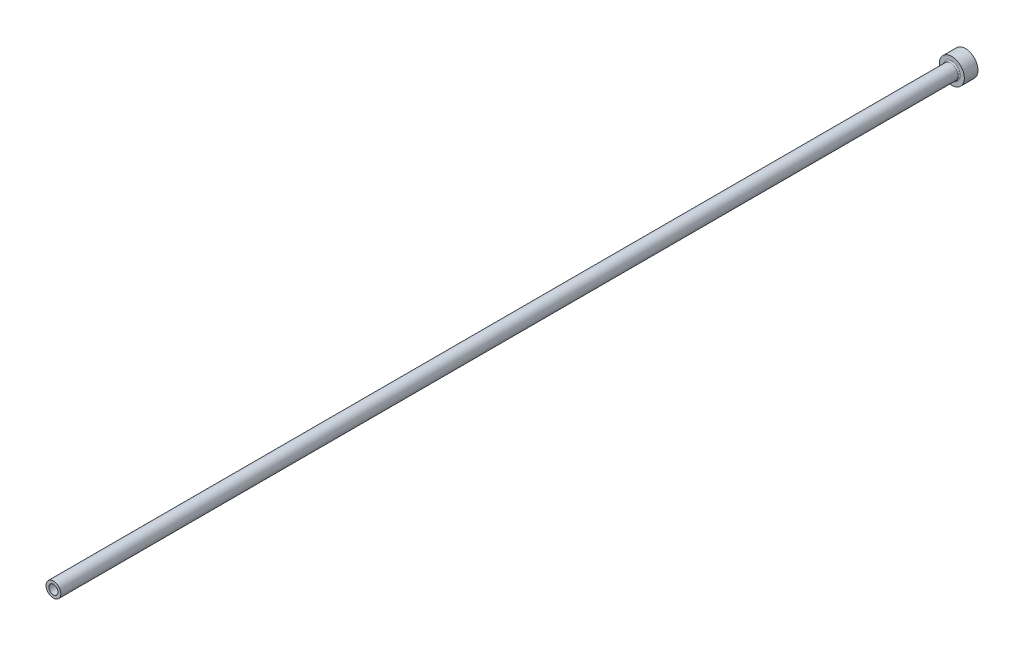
ISO-10303-21;
HEADER;
FILE_DESCRIPTION(('STEP AP214'),'2;1');
FILE_NAME('part.step','',(''),(''),'','','');
FILE_SCHEMA(('AUTOMOTIVE_DESIGN { 1 0 10303 214 1 1 1 1 }'));
ENDSEC;
DATA;
#1=APPLICATION_CONTEXT('core data for automotive mechanical design processes');
#2=APPLICATION_PROTOCOL_DEFINITION('international standard','automotive_design',2000,#1);
#3=PRODUCT_CONTEXT('',#1,'mechanical');
#4=PRODUCT('Part','Part','',(#3));
#5=PRODUCT_RELATED_PRODUCT_CATEGORY('part','',(#4));
#6=PRODUCT_DEFINITION_FORMATION('','',#4);
#7=PRODUCT_DEFINITION_CONTEXT('part definition',#1,'design');
#8=PRODUCT_DEFINITION('design','',#6,#7);
#9=PRODUCT_DEFINITION_SHAPE('','',#8);
#10=(LENGTH_UNIT() NAMED_UNIT(*) SI_UNIT(.MILLI.,.METRE.));
#11=(NAMED_UNIT(*) PLANE_ANGLE_UNIT() SI_UNIT($,.RADIAN.));
#12=(NAMED_UNIT(*) SI_UNIT($,.STERADIAN.) SOLID_ANGLE_UNIT());
#13=UNCERTAINTY_MEASURE_WITH_UNIT(LENGTH_MEASURE(1.E-05),#10,'distance_accuracy_value','');
#14=(GEOMETRIC_REPRESENTATION_CONTEXT(3) GLOBAL_UNCERTAINTY_ASSIGNED_CONTEXT((#13)) GLOBAL_UNIT_ASSIGNED_CONTEXT((#10,
#11,#12)) REPRESENTATION_CONTEXT('',''));
#15=CARTESIAN_POINT('',(0.,0.,0.));
#16=DIRECTION('',(0.,0.,1.));
#17=DIRECTION('',(1.,0.,0.));
#18=AXIS2_PLACEMENT_3D('',#15,#16,#17);
#19=CARTESIAN_POINT('',(0.,0.,400.));
#20=DIRECTION('',(0.,0.,-1.));
#21=DIRECTION('',(-1.,0.,0.));
#22=AXIS2_PLACEMENT_3D('',#19,#20,#21);
#23=PLANE('',#22);
#24=CARTESIAN_POINT('',(0.,0.,400.));
#25=DIRECTION('',(0.,0.,1.));
#26=DIRECTION('',(1.,0.,0.));
#27=AXIS2_PLACEMENT_3D('',#24,#25,#26);
#28=CIRCLE('',#27,1.99999999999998);
#29=CARTESIAN_POINT('',(1.99999999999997,0.,400.));
#30=VERTEX_POINT('',#29);
#31=EDGE_CURVE('E63',#30,#30,#28,.T.);
#32=ORIENTED_EDGE('',*,*,#31,.F.);
#33=EDGE_LOOP('',(#32));
#34=FACE_BOUND('',#33,.T.);
#35=CARTESIAN_POINT('',(0.,0.,400.));
#36=DIRECTION('',(0.,0.,1.));
#37=DIRECTION('',(1.,0.,0.));
#38=AXIS2_PLACEMENT_3D('',#35,#36,#37);
#39=CIRCLE('',#38,3.24999999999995);
#40=CARTESIAN_POINT('',(3.24999999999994,0.,400.));
#41=VERTEX_POINT('',#40);
#42=EDGE_CURVE('E54',#41,#41,#39,.T.);
#43=ORIENTED_EDGE('',*,*,#42,.T.);
#44=EDGE_LOOP('',(#43));
#45=FACE_BOUND('',#44,.T.);
#46=ADVANCED_FACE('F34',(#34,#45),#23,.F.);
#47=CARTESIAN_POINT('',(0.,0.,400.));
#48=DIRECTION('',(0.,0.,1.));
#49=DIRECTION('',(1.,0.,0.));
#50=AXIS2_PLACEMENT_3D('',#47,#48,#49);
#51=CYLINDRICAL_SURFACE('',#50,3.24999999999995);
#52=CARTESIAN_POINT('',(0.,0.,6.50000000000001));
#53=DIRECTION('',(0.,0.,1.));
#54=DIRECTION('',(1.,0.,0.));
#55=AXIS2_PLACEMENT_3D('',#52,#53,#54);
#56=CIRCLE('',#55,3.24999999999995);
#57=CARTESIAN_POINT('',(3.24999999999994,0.,6.50000000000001));
#58=VERTEX_POINT('',#57);
#59=EDGE_CURVE('E49',#58,#58,#56,.T.);
#60=ORIENTED_EDGE('',*,*,#59,.T.);
#61=EDGE_LOOP('',(#60));
#62=FACE_BOUND('',#61,.T.);
#63=ORIENTED_EDGE('',*,*,#42,.F.);
#64=EDGE_LOOP('',(#63));
#65=FACE_BOUND('',#64,.T.);
#66=ADVANCED_FACE('F92',(#62,#65),#51,.T.);
#67=CARTESIAN_POINT('',(0.,0.,6.));
#68=DIRECTION('',(0.,0.,1.));
#69=DIRECTION('',(1.,0.,0.));
#70=AXIS2_PLACEMENT_3D('',#67,#68,#69);
#71=PLANE('',#70);
#72=CARTESIAN_POINT('',(0.,0.,6.));
#73=DIRECTION('',(0.,0.,1.));
#74=DIRECTION('',(1.,0.,0.));
#75=AXIS2_PLACEMENT_3D('',#72,#73,#74);
#76=CIRCLE('',#75,3.74999999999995);
#77=CARTESIAN_POINT('',(3.74999999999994,0.,6.));
#78=VERTEX_POINT('',#77);
#79=EDGE_CURVE('E45',#78,#78,#76,.F.);
#80=ORIENTED_EDGE('',*,*,#79,.T.);
#81=EDGE_LOOP('',(#80));
#82=FACE_BOUND('',#81,.T.);
#83=CARTESIAN_POINT('',(0.,0.,6.00000000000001));
#84=DIRECTION('',(0.,0.,1.));
#85=DIRECTION('',(1.,0.,0.));
#86=AXIS2_PLACEMENT_3D('',#83,#84,#85);
#87=CIRCLE('',#86,5.49999999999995);
#88=CARTESIAN_POINT('',(5.49999999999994,0.,6.00000000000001));
#89=VERTEX_POINT('',#88);
#90=EDGE_CURVE('E57',#89,#89,#87,.T.);
#91=ORIENTED_EDGE('',*,*,#90,.T.);
#92=EDGE_LOOP('',(#91));
#93=FACE_BOUND('',#92,.T.);
#94=ADVANCED_FACE('F98',(#82,#93),#71,.T.);
#95=CARTESIAN_POINT('',(0.,0.,400.));
#96=DIRECTION('',(0.,0.,1.));
#97=DIRECTION('',(1.,0.,0.));
#98=AXIS2_PLACEMENT_3D('',#95,#96,#97);
#99=CYLINDRICAL_SURFACE('',#98,5.49999999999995);
#100=ORIENTED_EDGE('',*,*,#90,.F.);
#101=EDGE_LOOP('',(#100));
#102=FACE_BOUND('',#101,.T.);
#103=CARTESIAN_POINT('',(0.,0.,0.));
#104=DIRECTION('',(0.,0.,1.));
#105=DIRECTION('',(1.,0.,0.));
#106=AXIS2_PLACEMENT_3D('',#103,#104,#105);
#107=CIRCLE('',#106,5.49999999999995);
#108=CARTESIAN_POINT('',(5.49999999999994,0.,0.));
#109=VERTEX_POINT('',#108);
#110=EDGE_CURVE('E60',#109,#109,#107,.T.);
#111=ORIENTED_EDGE('',*,*,#110,.T.);
#112=EDGE_LOOP('',(#111));
#113=FACE_BOUND('',#112,.T.);
#114=ADVANCED_FACE('F89',(#102,#113),#99,.T.);
#115=CARTESIAN_POINT('',(0.,0.,0.));
#116=DIRECTION('',(0.,0.,1.));
#117=DIRECTION('',(1.,0.,0.));
#118=AXIS2_PLACEMENT_3D('',#115,#116,#117);
#119=PLANE('',#118);
#120=CARTESIAN_POINT('',(0.,0.,0.));
#121=DIRECTION('',(0.,0.,1.));
#122=DIRECTION('',(1.,0.,0.));
#123=AXIS2_PLACEMENT_3D('',#120,#121,#122);
#124=CIRCLE('',#123,2.75000000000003);
#125=CARTESIAN_POINT('',(2.75,0.,0.));
#126=VERTEX_POINT('',#125);
#127=EDGE_CURVE('E41',#126,#126,#124,.T.);
#128=ORIENTED_EDGE('',*,*,#127,.T.);
#129=EDGE_LOOP('',(#128));
#130=FACE_BOUND('',#129,.T.);
#131=ORIENTED_EDGE('',*,*,#110,.F.);
#132=EDGE_LOOP('',(#131));
#133=FACE_BOUND('',#132,.T.);
#134=ADVANCED_FACE('F83',(#130,#133),#119,.F.);
#135=CARTESIAN_POINT('',(0.,0.,400.));
#136=DIRECTION('',(0.,0.,1.));
#137=DIRECTION('',(1.,0.,0.));
#138=AXIS2_PLACEMENT_3D('',#135,#136,#137);
#139=CYLINDRICAL_SURFACE('',#138,2.00000000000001);
#140=ORIENTED_EDGE('',*,*,#31,.T.);
#141=EDGE_LOOP('',(#140));
#142=FACE_BOUND('',#141,.T.);
#143=CARTESIAN_POINT('',(0.,0.,250.));
#144=DIRECTION('',(0.,0.,1.));
#145=DIRECTION('',(1.,0.,0.));
#146=AXIS2_PLACEMENT_3D('',#143,#144,#145);
#147=CIRCLE('',#146,2.00000000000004);
#148=CARTESIAN_POINT('',(2.00000000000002,0.,250.));
#149=VERTEX_POINT('',#148);
#150=EDGE_CURVE('E66',#149,#149,#147,.T.);
#151=ORIENTED_EDGE('',*,*,#150,.F.);
#152=EDGE_LOOP('',(#151));
#153=FACE_BOUND('',#152,.T.);
#154=ADVANCED_FACE('F78',(#142,#153),#139,.F.);
#155=CARTESIAN_POINT('',(0.,0.,250.));
#156=DIRECTION('',(0.,0.,-1.));
#157=DIRECTION('',(-1.,0.,0.));
#158=AXIS2_PLACEMENT_3D('',#155,#156,#157);
#159=CONICAL_SURFACE('',#158,2.00000000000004,0.523598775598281);
#160=CARTESIAN_POINT('',(0.,0.,249.566987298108));
#161=DIRECTION('',(0.,0.,1.));
#162=DIRECTION('',(1.,0.,0.));
#163=AXIS2_PLACEMENT_3D('',#160,#161,#162);
#164=CIRCLE('',#163,2.25);
#165=CARTESIAN_POINT('',(2.24999999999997,0.,249.566987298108));
#166=VERTEX_POINT('',#165);
#167=EDGE_CURVE('E69',#166,#166,#164,.T.);
#168=ORIENTED_EDGE('',*,*,#167,.F.);
#169=EDGE_LOOP('',(#168));
#170=FACE_BOUND('',#169,.T.);
#171=ORIENTED_EDGE('',*,*,#150,.T.);
#172=EDGE_LOOP('',(#171));
#173=FACE_BOUND('',#172,.T.);
#174=ADVANCED_FACE('F75',(#170,#173),#159,.F.);
#175=CARTESIAN_POINT('',(0.,0.,400.));
#176=DIRECTION('',(0.,0.,1.));
#177=DIRECTION('',(1.,0.,0.));
#178=AXIS2_PLACEMENT_3D('',#175,#176,#177);
#179=CYLINDRICAL_SURFACE('',#178,2.24999999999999);
#180=CARTESIAN_POINT('',(0.,0.,0.500000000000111));
#181=DIRECTION('',(0.,0.,1.));
#182=DIRECTION('',(1.,0.,0.));
#183=AXIS2_PLACEMENT_3D('',#180,#181,#182);
#184=CIRCLE('',#183,2.24999999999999);
#185=CARTESIAN_POINT('',(2.24999999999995,0.,0.500000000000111));
#186=VERTEX_POINT('',#185);
#187=EDGE_CURVE('E10',#186,#186,#184,.F.);
#188=ORIENTED_EDGE('',*,*,#187,.T.);
#189=EDGE_LOOP('',(#188));
#190=FACE_BOUND('',#189,.T.);
#191=ORIENTED_EDGE('',*,*,#167,.T.);
#192=EDGE_LOOP('',(#191));
#193=FACE_BOUND('',#192,.T.);
#194=ADVANCED_FACE('F73',(#190,#193),#179,.F.);
#195=CARTESIAN_POINT('',(0.,0.,6.50000000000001));
#196=DIRECTION('',(0.,0.,1.));
#197=DIRECTION('',(1.,0.,0.));
#198=AXIS2_PLACEMENT_3D('',#195,#196,#197);
#199=TOROIDAL_SURFACE('',#198,3.74999999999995,0.5);
#200=ORIENTED_EDGE('',*,*,#79,.F.);
#201=EDGE_LOOP('',(#200));
#202=FACE_BOUND('',#201,.T.);
#203=ORIENTED_EDGE('',*,*,#59,.F.);
#204=EDGE_LOOP('',(#203));
#205=FACE_BOUND('',#204,.T.);
#206=ADVANCED_FACE('F104',(#202,#205),#199,.F.);
#207=CARTESIAN_POINT('',(0.,0.,0.));
#208=DIRECTION('',(0.,0.,-1.));
#209=DIRECTION('',(-1.,0.,0.));
#210=AXIS2_PLACEMENT_3D('',#207,#208,#209);
#211=CONICAL_SURFACE('',#210,2.75000000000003,0.785398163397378);
#212=ORIENTED_EDGE('',*,*,#187,.F.);
#213=EDGE_LOOP('',(#212));
#214=FACE_BOUND('',#213,.T.);
#215=ORIENTED_EDGE('',*,*,#127,.F.);
#216=EDGE_LOOP('',(#215));
#217=FACE_BOUND('',#216,.T.);
#218=ADVANCED_FACE('F36',(#214,#217),#211,.F.);
#219=CLOSED_SHELL('',(#46,#66,#94,#114,#134,#154,#174,#194,#206,#218));
#220=MANIFOLD_SOLID_BREP('B2',#219);
#221=ADVANCED_BREP_SHAPE_REPRESENTATION('',(#18,#220),#14);
#222=SHAPE_DEFINITION_REPRESENTATION(#9,#221);
ENDSEC;
END-ISO-10303-21;
